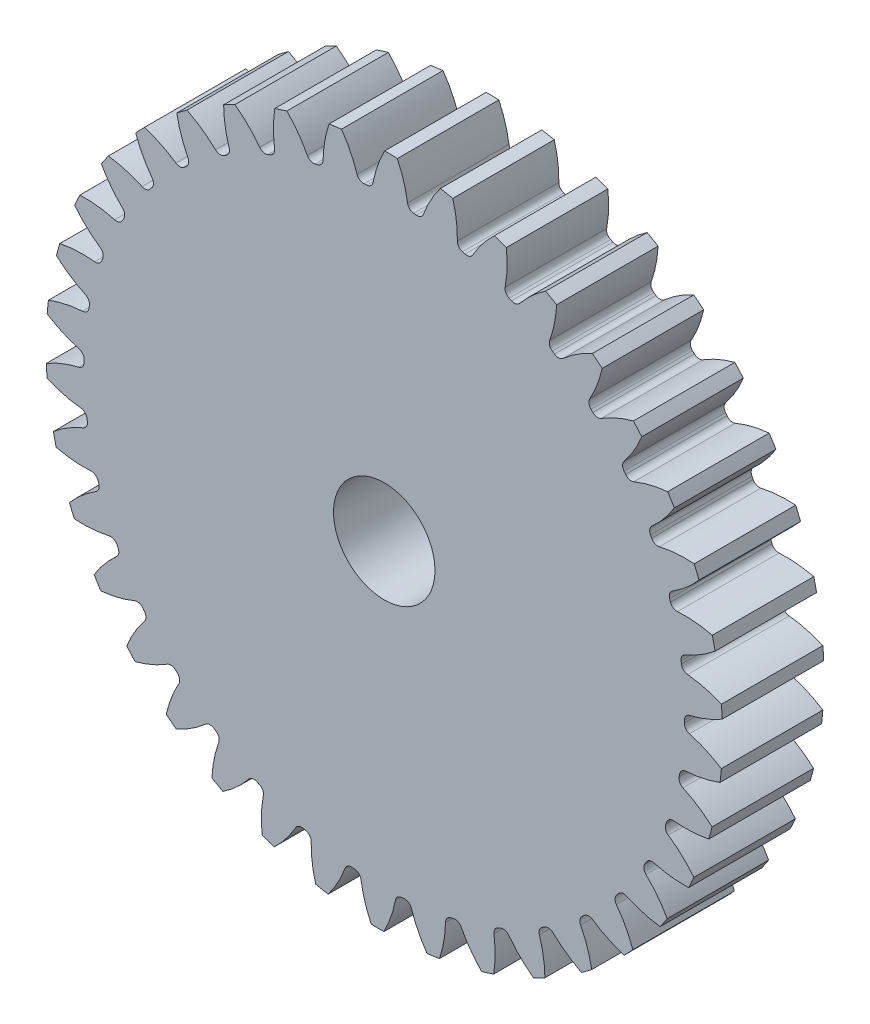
from build123d import *

# Parameters (mm, degrees)
SKETCH3_R         = 338.666666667
GEARBODY_DEPTH    = 101.6
TOOTHCUT_DEPTH    = 490.604720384
CIRPATTERN1_COUNT = 38
BOREDIA_R         = 50.8
BORE_DEPTH        = 12700


with BuildPart() as part:
    # Sketch3 → gearBody (new body)
    with BuildSketch(Plane.XY):
        Circle(SKETCH3_R)
    extrude(amount=GEARBODY_DEPTH)

    # Sketch2 → toothCut (cut, through all)
    with BuildSketch(Plane.XY):
        with BuildLine():
            ThreePointArc((300.477574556, -7.317670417), (300.507077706, -5.984760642), (300.530668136, -4.651733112))
            ThreePointArc((300.530668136, -4.651733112), (302.056401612, -0.432739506), (305.85574817, 1.953205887))
            ThreePointArc((305.85574817, 1.953205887), (322.761455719, 7.27868831), (338.666666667, 15.100962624))
            ThreePointArc((338.666666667, 15.100962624), (338.935962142, -6.750092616), (337.796874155, -28.57309914))
            ThreePointArc((337.796874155, -28.57309914), (322.215721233, -20.123756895), (305.53545456, -14.129391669))
            ThreePointArc((305.53545456, -14.129391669), (301.834117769, -11.594066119), (300.477574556, -7.317670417))
        make_face()
    toothcut = extrude(amount=TOOTHCUT_DEPTH, mode=Mode.SUBTRACT)

    # CirPattern1: toothCut ×38 about axis
    cirpattern1_axis = Axis((0, 0, 0), (0, 0, 1))
    for i in range(1, CIRPATTERN1_COUNT):
        add(toothcut.rotate(cirpattern1_axis, i * 360 / CIRPATTERN1_COUNT), mode=Mode.SUBTRACT)

    # boreDia → bore (cut, symmetric)
    with BuildSketch(Plane.XY):
        Circle(BOREDIA_R)
    extrude(amount=BORE_DEPTH, both=True, mode=Mode.SUBTRACT)


solid = part.part
